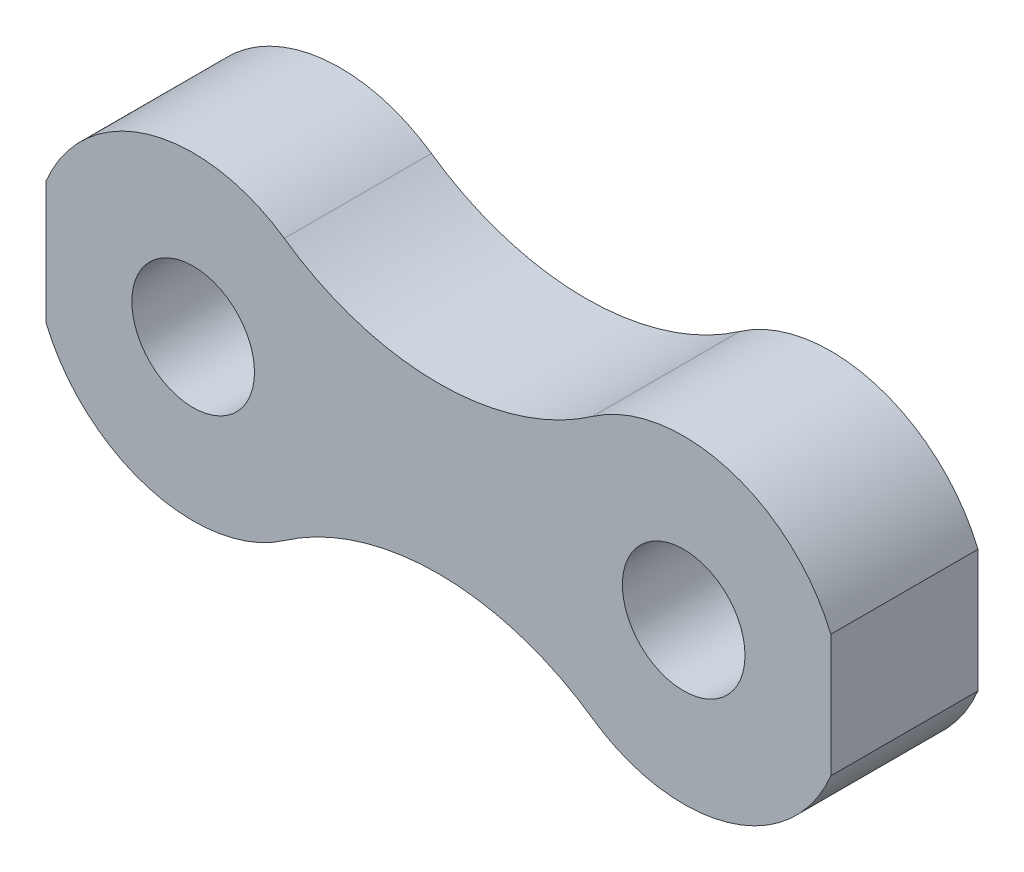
ISO-10303-21;
HEADER;
FILE_DESCRIPTION(('STEP AP214'),'2;1');
FILE_NAME('part.step','',(''),(''),'','','');
FILE_SCHEMA(('AUTOMOTIVE_DESIGN { 1 0 10303 214 1 1 1 1 }'));
ENDSEC;
DATA;
#1=APPLICATION_CONTEXT('core data for automotive mechanical design processes');
#2=APPLICATION_PROTOCOL_DEFINITION('international standard','automotive_design',2000,#1);
#3=PRODUCT_CONTEXT('',#1,'mechanical');
#4=PRODUCT('Part','Part','',(#3));
#5=PRODUCT_RELATED_PRODUCT_CATEGORY('part','',(#4));
#6=PRODUCT_DEFINITION_FORMATION('','',#4);
#7=PRODUCT_DEFINITION_CONTEXT('part definition',#1,'design');
#8=PRODUCT_DEFINITION('design','',#6,#7);
#9=PRODUCT_DEFINITION_SHAPE('','',#8);
#10=(LENGTH_UNIT() NAMED_UNIT(*) SI_UNIT(.MILLI.,.METRE.));
#11=(NAMED_UNIT(*) PLANE_ANGLE_UNIT() SI_UNIT($,.RADIAN.));
#12=(NAMED_UNIT(*) SI_UNIT($,.STERADIAN.) SOLID_ANGLE_UNIT());
#13=UNCERTAINTY_MEASURE_WITH_UNIT(LENGTH_MEASURE(1.E-05),#10,'distance_accuracy_value','');
#14=(GEOMETRIC_REPRESENTATION_CONTEXT(3) GLOBAL_UNCERTAINTY_ASSIGNED_CONTEXT((#13)) GLOBAL_UNIT_ASSIGNED_CONTEXT((#10,
#11,#12)) REPRESENTATION_CONTEXT('',''));
#15=CARTESIAN_POINT('',(0.,0.,0.));
#16=DIRECTION('',(0.,0.,1.));
#17=DIRECTION('',(1.,0.,0.));
#18=AXIS2_PLACEMENT_3D('',#15,#16,#17);
#19=CARTESIAN_POINT('',(5.,7.18070330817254,3.));
#20=DIRECTION('',(0.,0.,-1.));
#21=DIRECTION('',(-1.,0.,0.));
#22=AXIS2_PLACEMENT_3D('',#19,#20,#21);
#23=PLANE('',#22);
#24=CARTESIAN_POINT('',(0.,0.,3.));
#25=DIRECTION('',(0.,0.,1.));
#26=DIRECTION('',(1.,0.,0.));
#27=AXIS2_PLACEMENT_3D('',#24,#25,#26);
#28=CIRCLE('',#27,2.5);
#29=CARTESIAN_POINT('',(2.5,0.,3.));
#30=VERTEX_POINT('',#29);
#31=EDGE_CURVE('E132',#30,#30,#28,.T.);
#32=ORIENTED_EDGE('',*,*,#31,.F.);
#33=EDGE_LOOP('',(#32));
#34=FACE_BOUND('',#33,.T.);
#35=CARTESIAN_POINT('',(20.,0.,3.));
#36=DIRECTION('',(0.,0.,1.));
#37=DIRECTION('',(1.,0.,0.));
#38=AXIS2_PLACEMENT_3D('',#35,#36,#37);
#39=CIRCLE('',#38,2.5);
#40=CARTESIAN_POINT('',(22.5,0.,3.));
#41=VERTEX_POINT('',#40);
#42=EDGE_CURVE('E165',#41,#41,#39,.T.);
#43=ORIENTED_EDGE('',*,*,#42,.F.);
#44=EDGE_LOOP('',(#43));
#45=FACE_BOUND('',#44,.T.);
#46=DIRECTION('',(0.,-1.,0.));
#47=VECTOR('',#46,1.);
#48=CARTESIAN_POINT('',(-6.,10.5178208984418,3.));
#49=LINE('',#48,#47);
#50=CARTESIAN_POINT('',(-6.,2.5,3.));
#51=VERTEX_POINT('',#50);
#52=CARTESIAN_POINT('',(-6.,-2.5,3.));
#53=VERTEX_POINT('',#52);
#54=EDGE_CURVE('E104',#51,#53,#49,.T.);
#55=ORIENTED_EDGE('',*,*,#54,.T.);
#56=CARTESIAN_POINT('',(0.,0.,3.));
#57=DIRECTION('',(0.,0.,1.));
#58=DIRECTION('',(1.,0.,0.));
#59=AXIS2_PLACEMENT_3D('',#56,#57,#58);
#60=CIRCLE('',#59,6.5);
#61=CARTESIAN_POINT('',(3.71428571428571,-5.33423674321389,3.));
#62=VERTEX_POINT('',#61);
#63=EDGE_CURVE('E154',#53,#62,#60,.T.);
#64=ORIENTED_EDGE('',*,*,#63,.T.);
#65=CARTESIAN_POINT('',(10.,-14.3614066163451,3.));
#66=DIRECTION('',(0.,0.,-1.));
#67=DIRECTION('',(1.,0.,0.));
#68=AXIS2_PLACEMENT_3D('',#65,#66,#67);
#69=CIRCLE('',#68,11.);
#70=CARTESIAN_POINT('',(16.2857142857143,-5.33423674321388,3.));
#71=VERTEX_POINT('',#70);
#72=EDGE_CURVE('E117',#62,#71,#69,.T.);
#73=ORIENTED_EDGE('',*,*,#72,.T.);
#74=CARTESIAN_POINT('',(20.,0.,3.));
#75=DIRECTION('',(0.,0.,1.));
#76=DIRECTION('',(1.,0.,0.));
#77=AXIS2_PLACEMENT_3D('',#74,#75,#76);
#78=CIRCLE('',#77,6.5);
#79=CARTESIAN_POINT('',(26.,-2.5,3.));
#80=VERTEX_POINT('',#79);
#81=EDGE_CURVE('E111',#71,#80,#78,.T.);
#82=ORIENTED_EDGE('',*,*,#81,.T.);
#83=DIRECTION('',(0.,1.,0.));
#84=VECTOR('',#83,1.);
#85=CARTESIAN_POINT('',(26.,10.5178208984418,3.));
#86=LINE('',#85,#84);
#87=CARTESIAN_POINT('',(26.,2.5,3.));
#88=VERTEX_POINT('',#87);
#89=EDGE_CURVE('E96',#80,#88,#86,.T.);
#90=ORIENTED_EDGE('',*,*,#89,.T.);
#91=CARTESIAN_POINT('',(16.2857142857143,5.33423674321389,3.));
#92=VERTEX_POINT('',#91);
#93=EDGE_CURVE('E120',#88,#92,#78,.T.);
#94=ORIENTED_EDGE('',*,*,#93,.T.);
#95=CARTESIAN_POINT('',(10.,14.3614066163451,3.));
#96=DIRECTION('',(0.,0.,-1.));
#97=DIRECTION('',(-1.,0.,0.));
#98=AXIS2_PLACEMENT_3D('',#95,#96,#97);
#99=CIRCLE('',#98,11.);
#100=CARTESIAN_POINT('',(3.71428571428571,5.33423674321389,3.));
#101=VERTEX_POINT('',#100);
#102=EDGE_CURVE('E139',#92,#101,#99,.T.);
#103=ORIENTED_EDGE('',*,*,#102,.T.);
#104=EDGE_CURVE('E157',#101,#51,#60,.T.);
#105=ORIENTED_EDGE('',*,*,#104,.T.);
#106=EDGE_LOOP('',(#55,#64,#73,#82,#90,#94,#103,#105));
#107=FACE_BOUND('',#106,.T.);
#108=ADVANCED_FACE('F34',(#34,#45,#107),#23,.F.);
#109=CARTESIAN_POINT('',(5.,7.18070330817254,-3.));
#110=DIRECTION('',(0.,0.,-1.));
#111=DIRECTION('',(-1.,0.,0.));
#112=AXIS2_PLACEMENT_3D('',#109,#110,#111);
#113=PLANE('',#112);
#114=CARTESIAN_POINT('',(0.,0.,-3.));
#115=DIRECTION('',(0.,0.,1.));
#116=DIRECTION('',(1.,0.,0.));
#117=AXIS2_PLACEMENT_3D('',#114,#115,#116);
#118=CIRCLE('',#117,2.5);
#119=CARTESIAN_POINT('',(2.5,0.,-3.));
#120=VERTEX_POINT('',#119);
#121=EDGE_CURVE('E162',#120,#120,#118,.T.);
#122=ORIENTED_EDGE('',*,*,#121,.T.);
#123=EDGE_LOOP('',(#122));
#124=FACE_BOUND('',#123,.T.);
#125=CARTESIAN_POINT('',(20.,0.,-3.));
#126=DIRECTION('',(0.,0.,1.));
#127=DIRECTION('',(1.,0.,0.));
#128=AXIS2_PLACEMENT_3D('',#125,#126,#127);
#129=CIRCLE('',#128,2.5);
#130=CARTESIAN_POINT('',(22.5,0.,-3.));
#131=VERTEX_POINT('',#130);
#132=EDGE_CURVE('E168',#131,#131,#129,.T.);
#133=ORIENTED_EDGE('',*,*,#132,.T.);
#134=EDGE_LOOP('',(#133));
#135=FACE_BOUND('',#134,.T.);
#136=CARTESIAN_POINT('',(0.,0.,-3.));
#137=DIRECTION('',(0.,0.,1.));
#138=DIRECTION('',(1.,0.,0.));
#139=AXIS2_PLACEMENT_3D('',#136,#137,#138);
#140=CIRCLE('',#139,6.5);
#141=CARTESIAN_POINT('',(-6.,-2.5,-3.));
#142=VERTEX_POINT('',#141);
#143=CARTESIAN_POINT('',(3.71428571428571,-5.33423674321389,-3.));
#144=VERTEX_POINT('',#143);
#145=EDGE_CURVE('E131',#142,#144,#140,.T.);
#146=ORIENTED_EDGE('',*,*,#145,.F.);
#147=DIRECTION('',(0.,-1.,0.));
#148=VECTOR('',#147,1.);
#149=CARTESIAN_POINT('',(-6.,10.5178208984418,-3.));
#150=LINE('',#149,#148);
#151=CARTESIAN_POINT('',(-6.,2.5,-3.));
#152=VERTEX_POINT('',#151);
#153=EDGE_CURVE('E48',#152,#142,#150,.T.);
#154=ORIENTED_EDGE('',*,*,#153,.F.);
#155=CARTESIAN_POINT('',(3.71428571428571,5.33423674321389,-3.));
#156=VERTEX_POINT('',#155);
#157=EDGE_CURVE('E133',#156,#152,#140,.T.);
#158=ORIENTED_EDGE('',*,*,#157,.F.);
#159=CARTESIAN_POINT('',(10.,14.3614066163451,-3.));
#160=DIRECTION('',(0.,0.,-1.));
#161=DIRECTION('',(-1.,0.,0.));
#162=AXIS2_PLACEMENT_3D('',#159,#160,#161);
#163=CIRCLE('',#162,11.);
#164=CARTESIAN_POINT('',(16.2857142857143,5.33423674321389,-3.));
#165=VERTEX_POINT('',#164);
#166=EDGE_CURVE('E128',#165,#156,#163,.T.);
#167=ORIENTED_EDGE('',*,*,#166,.F.);
#168=CARTESIAN_POINT('',(20.,0.,-3.));
#169=DIRECTION('',(0.,0.,1.));
#170=DIRECTION('',(1.,0.,0.));
#171=AXIS2_PLACEMENT_3D('',#168,#169,#170);
#172=CIRCLE('',#171,6.5);
#173=CARTESIAN_POINT('',(26.,2.5,-3.));
#174=VERTEX_POINT('',#173);
#175=EDGE_CURVE('E138',#174,#165,#172,.T.);
#176=ORIENTED_EDGE('',*,*,#175,.F.);
#177=DIRECTION('',(0.,1.,0.));
#178=VECTOR('',#177,1.);
#179=CARTESIAN_POINT('',(26.,10.5178208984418,-3.));
#180=LINE('',#179,#178);
#181=CARTESIAN_POINT('',(26.,-2.5,-3.));
#182=VERTEX_POINT('',#181);
#183=EDGE_CURVE('E56',#182,#174,#180,.T.);
#184=ORIENTED_EDGE('',*,*,#183,.F.);
#185=CARTESIAN_POINT('',(16.2857142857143,-5.33423674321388,-3.));
#186=VERTEX_POINT('',#185);
#187=EDGE_CURVE('E113',#186,#182,#172,.T.);
#188=ORIENTED_EDGE('',*,*,#187,.F.);
#189=CARTESIAN_POINT('',(10.,-14.3614066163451,-3.));
#190=DIRECTION('',(0.,0.,-1.));
#191=DIRECTION('',(1.,0.,0.));
#192=AXIS2_PLACEMENT_3D('',#189,#190,#191);
#193=CIRCLE('',#192,11.);
#194=EDGE_CURVE('E136',#144,#186,#193,.T.);
#195=ORIENTED_EDGE('',*,*,#194,.F.);
#196=EDGE_LOOP('',(#146,#154,#158,#167,#176,#184,#188,#195));
#197=FACE_BOUND('',#196,.T.);
#198=ADVANCED_FACE('F180',(#124,#135,#197),#113,.T.);
#199=CARTESIAN_POINT('',(0.,0.,3.));
#200=DIRECTION('',(0.,0.,-1.));
#201=DIRECTION('',(-1.,0.,0.));
#202=AXIS2_PLACEMENT_3D('',#199,#200,#201);
#203=CYLINDRICAL_SURFACE('',#202,6.5);
#204=DIRECTION('',(0.,0.,-1.));
#205=VECTOR('',#204,1.);
#206=CARTESIAN_POINT('',(-6.,2.5,3.));
#207=LINE('',#206,#205);
#208=EDGE_CURVE('E12',#51,#152,#207,.T.);
#209=ORIENTED_EDGE('',*,*,#208,.F.);
#210=ORIENTED_EDGE('',*,*,#104,.F.);
#211=DIRECTION('',(0.,0.,-1.));
#212=VECTOR('',#211,1.);
#213=CARTESIAN_POINT('',(3.71428571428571,5.33423674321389,3.));
#214=LINE('',#213,#212);
#215=EDGE_CURVE('E145',#101,#156,#214,.T.);
#216=ORIENTED_EDGE('',*,*,#215,.T.);
#217=ORIENTED_EDGE('',*,*,#157,.T.);
#218=EDGE_LOOP('',(#209,#210,#216,#217));
#219=FACE_BOUND('',#218,.T.);
#220=ADVANCED_FACE('F186',(#219),#203,.T.);
#221=DIRECTION('',(0.,0.,-1.));
#222=VECTOR('',#221,1.);
#223=CARTESIAN_POINT('',(-6.,-2.5,3.));
#224=LINE('',#223,#222);
#225=EDGE_CURVE('E42',#142,#53,#224,.F.);
#226=ORIENTED_EDGE('',*,*,#225,.F.);
#227=ORIENTED_EDGE('',*,*,#145,.T.);
#228=DIRECTION('',(0.,0.,-1.));
#229=VECTOR('',#228,1.);
#230=CARTESIAN_POINT('',(3.71428571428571,-5.33423674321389,3.));
#231=LINE('',#230,#229);
#232=EDGE_CURVE('E142',#62,#144,#231,.T.);
#233=ORIENTED_EDGE('',*,*,#232,.F.);
#234=ORIENTED_EDGE('',*,*,#63,.F.);
#235=EDGE_LOOP('',(#226,#227,#233,#234));
#236=FACE_BOUND('',#235,.T.);
#237=ADVANCED_FACE('F159',(#236),#203,.T.);
#238=CARTESIAN_POINT('',(20.,0.,3.));
#239=DIRECTION('',(0.,0.,-1.));
#240=DIRECTION('',(-1.,0.,0.));
#241=AXIS2_PLACEMENT_3D('',#238,#239,#240);
#242=CYLINDRICAL_SURFACE('',#241,6.5);
#243=DIRECTION('',(0.,0.,-1.));
#244=VECTOR('',#243,1.);
#245=CARTESIAN_POINT('',(26.,-2.5,3.));
#246=LINE('',#245,#244);
#247=EDGE_CURVE('E99',#80,#182,#246,.T.);
#248=ORIENTED_EDGE('',*,*,#247,.F.);
#249=ORIENTED_EDGE('',*,*,#81,.F.);
#250=DIRECTION('',(0.,0.,-1.));
#251=VECTOR('',#250,1.);
#252=CARTESIAN_POINT('',(16.2857142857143,-5.33423674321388,3.));
#253=LINE('',#252,#251);
#254=EDGE_CURVE('E123',#71,#186,#253,.T.);
#255=ORIENTED_EDGE('',*,*,#254,.T.);
#256=ORIENTED_EDGE('',*,*,#187,.T.);
#257=EDGE_LOOP('',(#248,#249,#255,#256));
#258=FACE_BOUND('',#257,.T.);
#259=ADVANCED_FACE('F109',(#258),#242,.T.);
#260=DIRECTION('',(0.,0.,-1.));
#261=VECTOR('',#260,1.);
#262=CARTESIAN_POINT('',(26.,2.5,3.));
#263=LINE('',#262,#261);
#264=EDGE_CURVE('E100',#174,#88,#263,.F.);
#265=ORIENTED_EDGE('',*,*,#264,.F.);
#266=ORIENTED_EDGE('',*,*,#175,.T.);
#267=DIRECTION('',(0.,0.,-1.));
#268=VECTOR('',#267,1.);
#269=CARTESIAN_POINT('',(16.2857142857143,5.33423674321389,3.));
#270=LINE('',#269,#268);
#271=EDGE_CURVE('E119',#92,#165,#270,.T.);
#272=ORIENTED_EDGE('',*,*,#271,.F.);
#273=ORIENTED_EDGE('',*,*,#93,.F.);
#274=EDGE_LOOP('',(#265,#266,#272,#273));
#275=FACE_BOUND('',#274,.T.);
#276=ADVANCED_FACE('F196',(#275),#242,.T.);
#277=CARTESIAN_POINT('',(10.,14.3614066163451,3.));
#278=DIRECTION('',(0.,0.,-1.));
#279=DIRECTION('',(-1.,0.,0.));
#280=AXIS2_PLACEMENT_3D('',#277,#278,#279);
#281=CYLINDRICAL_SURFACE('',#280,11.);
#282=ORIENTED_EDGE('',*,*,#166,.T.);
#283=ORIENTED_EDGE('',*,*,#215,.F.);
#284=ORIENTED_EDGE('',*,*,#102,.F.);
#285=ORIENTED_EDGE('',*,*,#271,.T.);
#286=EDGE_LOOP('',(#282,#283,#284,#285));
#287=FACE_BOUND('',#286,.T.);
#288=ADVANCED_FACE('F36',(#287),#281,.F.);
#289=CARTESIAN_POINT('',(10.,-14.3614066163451,3.));
#290=DIRECTION('',(0.,0.,-1.));
#291=DIRECTION('',(-1.,0.,0.));
#292=AXIS2_PLACEMENT_3D('',#289,#290,#291);
#293=CYLINDRICAL_SURFACE('',#292,11.);
#294=ORIENTED_EDGE('',*,*,#194,.T.);
#295=ORIENTED_EDGE('',*,*,#254,.F.);
#296=ORIENTED_EDGE('',*,*,#72,.F.);
#297=ORIENTED_EDGE('',*,*,#232,.T.);
#298=EDGE_LOOP('',(#294,#295,#296,#297));
#299=FACE_BOUND('',#298,.T.);
#300=ADVANCED_FACE('F197',(#299),#293,.F.);
#301=CARTESIAN_POINT('',(0.,0.,3.));
#302=DIRECTION('',(0.,0.,-1.));
#303=DIRECTION('',(-1.,0.,0.));
#304=AXIS2_PLACEMENT_3D('',#301,#302,#303);
#305=CYLINDRICAL_SURFACE('',#304,2.5);
#306=ORIENTED_EDGE('',*,*,#31,.T.);
#307=EDGE_LOOP('',(#306));
#308=FACE_BOUND('',#307,.T.);
#309=ORIENTED_EDGE('',*,*,#121,.F.);
#310=EDGE_LOOP('',(#309));
#311=FACE_BOUND('',#310,.T.);
#312=ADVANCED_FACE('F191',(#308,#311),#305,.F.);
#313=CARTESIAN_POINT('',(20.,0.,3.));
#314=DIRECTION('',(0.,0.,-1.));
#315=DIRECTION('',(-1.,0.,0.));
#316=AXIS2_PLACEMENT_3D('',#313,#314,#315);
#317=CYLINDRICAL_SURFACE('',#316,2.5);
#318=ORIENTED_EDGE('',*,*,#42,.T.);
#319=EDGE_LOOP('',(#318));
#320=FACE_BOUND('',#319,.T.);
#321=ORIENTED_EDGE('',*,*,#132,.F.);
#322=EDGE_LOOP('',(#321));
#323=FACE_BOUND('',#322,.T.);
#324=ADVANCED_FACE('F176',(#320,#323),#317,.F.);
#325=CARTESIAN_POINT('',(26.,10.5178208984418,-3.));
#326=DIRECTION('',(1.,0.,0.));
#327=DIRECTION('',(0.,1.,0.));
#328=AXIS2_PLACEMENT_3D('',#325,#326,#327);
#329=PLANE('',#328);
#330=ORIENTED_EDGE('',*,*,#247,.T.);
#331=ORIENTED_EDGE('',*,*,#183,.T.);
#332=ORIENTED_EDGE('',*,*,#264,.T.);
#333=ORIENTED_EDGE('',*,*,#89,.F.);
#334=EDGE_LOOP('',(#330,#331,#332,#333));
#335=FACE_BOUND('',#334,.T.);
#336=ADVANCED_FACE('F98',(#335),#329,.T.);
#337=CARTESIAN_POINT('',(-6.,10.5178208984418,-3.));
#338=DIRECTION('',(-1.,0.,0.));
#339=DIRECTION('',(0.,-1.,0.));
#340=AXIS2_PLACEMENT_3D('',#337,#338,#339);
#341=PLANE('',#340);
#342=ORIENTED_EDGE('',*,*,#208,.T.);
#343=ORIENTED_EDGE('',*,*,#153,.T.);
#344=ORIENTED_EDGE('',*,*,#225,.T.);
#345=ORIENTED_EDGE('',*,*,#54,.F.);
#346=EDGE_LOOP('',(#342,#343,#344,#345));
#347=FACE_BOUND('',#346,.T.);
#348=ADVANCED_FACE('F148',(#347),#341,.T.);
#349=CLOSED_SHELL('',(#108,#198,#220,#237,#259,#276,#288,#300,#312,#324,#336,#348));
#350=MANIFOLD_SOLID_BREP('B2',#349);
#351=ADVANCED_BREP_SHAPE_REPRESENTATION('',(#18,#350),#14);
#352=SHAPE_DEFINITION_REPRESENTATION(#9,#351);
ENDSEC;
END-ISO-10303-21;
